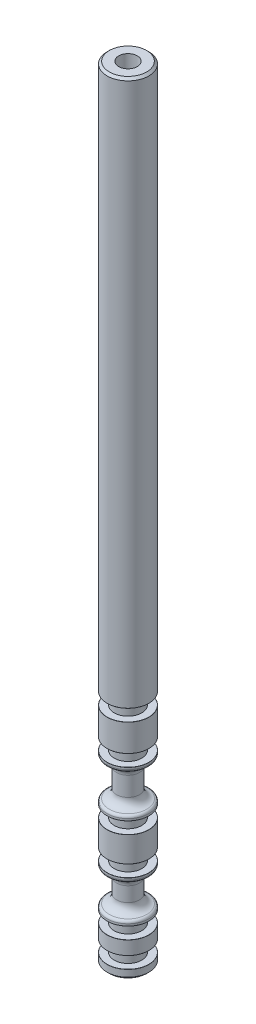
ISO-10303-21;
HEADER;
FILE_DESCRIPTION(('STEP AP214'),'2;1');
FILE_NAME('part.step','',(''),(''),'','','');
FILE_SCHEMA(('AUTOMOTIVE_DESIGN { 1 0 10303 214 1 1 1 1 }'));
ENDSEC;
DATA;
#1=APPLICATION_CONTEXT('core data for automotive mechanical design processes');
#2=APPLICATION_PROTOCOL_DEFINITION('international standard','automotive_design',2000,#1);
#3=PRODUCT_CONTEXT('',#1,'mechanical');
#4=PRODUCT('Part','Part','',(#3));
#5=PRODUCT_RELATED_PRODUCT_CATEGORY('part','',(#4));
#6=PRODUCT_DEFINITION_FORMATION('','',#4);
#7=PRODUCT_DEFINITION_CONTEXT('part definition',#1,'design');
#8=PRODUCT_DEFINITION('design','',#6,#7);
#9=PRODUCT_DEFINITION_SHAPE('','',#8);
#10=(LENGTH_UNIT() NAMED_UNIT(*) SI_UNIT(.MILLI.,.METRE.));
#11=(NAMED_UNIT(*) PLANE_ANGLE_UNIT() SI_UNIT($,.RADIAN.));
#12=(NAMED_UNIT(*) SI_UNIT($,.STERADIAN.) SOLID_ANGLE_UNIT());
#13=UNCERTAINTY_MEASURE_WITH_UNIT(LENGTH_MEASURE(1.E-05),#10,'distance_accuracy_value','');
#14=(GEOMETRIC_REPRESENTATION_CONTEXT(3) GLOBAL_UNCERTAINTY_ASSIGNED_CONTEXT((#13)) GLOBAL_UNIT_ASSIGNED_CONTEXT((#10,
#11,#12)) REPRESENTATION_CONTEXT('',''));
#15=CARTESIAN_POINT('',(0.,0.,0.));
#16=DIRECTION('',(0.,0.,1.));
#17=DIRECTION('',(1.,0.,0.));
#18=AXIS2_PLACEMENT_3D('',#15,#16,#17);
#19=CARTESIAN_POINT('',(0.,-5.94663666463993,0.));
#20=DIRECTION('',(0.,-1.,0.));
#21=DIRECTION('',(0.,0.,-1.));
#22=AXIS2_PLACEMENT_3D('',#19,#20,#21);
#23=CYLINDRICAL_SURFACE('',#22,2.29500000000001);
#24=CARTESIAN_POINT('',(0.,0.250000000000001,0.));
#25=DIRECTION('',(0.,-1.,0.));
#26=DIRECTION('',(0.,0.,-1.));
#27=AXIS2_PLACEMENT_3D('',#24,#25,#26);
#28=CIRCLE('',#27,2.29500000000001);
#29=CARTESIAN_POINT('',(0.,0.250000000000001,-2.29500000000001));
#30=VERTEX_POINT('',#29);
#31=EDGE_CURVE('E209',#30,#30,#28,.F.);
#32=ORIENTED_EDGE('',*,*,#31,.T.);
#33=EDGE_LOOP('',(#32));
#34=FACE_BOUND('',#33,.T.);
#35=CARTESIAN_POINT('',(0.,0.989999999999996,0.));
#36=DIRECTION('',(0.,1.,0.));
#37=DIRECTION('',(0.,0.,1.));
#38=AXIS2_PLACEMENT_3D('',#35,#36,#37);
#39=CIRCLE('',#38,2.29500000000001);
#40=CARTESIAN_POINT('',(0.,0.989999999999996,2.29500000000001));
#41=VERTEX_POINT('',#40);
#42=EDGE_CURVE('E200',#41,#41,#39,.F.);
#43=ORIENTED_EDGE('',*,*,#42,.T.);
#44=EDGE_LOOP('',(#43));
#45=FACE_BOUND('',#44,.T.);
#46=ADVANCED_FACE('F37',(#34,#45),#23,.T.);
#47=CARTESIAN_POINT('',(2.29500000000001,0.,0.));
#48=DIRECTION('',(0.,-1.,0.));
#49=DIRECTION('',(0.,0.,-1.));
#50=AXIS2_PLACEMENT_3D('',#47,#48,#49);
#51=PLANE('',#50);
#52=CARTESIAN_POINT('',(0.,0.,0.));
#53=DIRECTION('',(0.,-1.,0.));
#54=DIRECTION('',(0.,0.,-1.));
#55=AXIS2_PLACEMENT_3D('',#52,#53,#54);
#56=CIRCLE('',#55,2.045);
#57=CARTESIAN_POINT('',(0.,0.,-2.045));
#58=VERTEX_POINT('',#57);
#59=EDGE_CURVE('E206',#58,#58,#56,.T.);
#60=ORIENTED_EDGE('',*,*,#59,.T.);
#61=EDGE_LOOP('',(#60));
#62=FACE_BOUND('',#61,.T.);
#63=ADVANCED_FACE('F227',(#62),#51,.T.);
#64=CARTESIAN_POINT('',(2.5384511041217,2.3,0.));
#65=DIRECTION('',(0.,-1.,0.));
#66=DIRECTION('',(0.,0.,-1.));
#67=AXIS2_PLACEMENT_3D('',#64,#65,#66);
#68=PLANE('',#67);
#69=CARTESIAN_POINT('',(0.,2.3,0.));
#70=DIRECTION('',(0.,-1.,0.));
#71=DIRECTION('',(0.,0.,-1.));
#72=AXIS2_PLACEMENT_3D('',#69,#70,#71);
#73=CIRCLE('',#72,2.285);
#74=CARTESIAN_POINT('',(0.,2.3,2.285));
#75=VERTEX_POINT('',#74);
#76=EDGE_CURVE('E197',#75,#75,#73,.T.);
#77=ORIENTED_EDGE('',*,*,#76,.T.);
#78=EDGE_LOOP('',(#77));
#79=FACE_BOUND('',#78,.T.);
#80=CARTESIAN_POINT('',(0.,2.3,0.));
#81=DIRECTION('',(0.,1.,0.));
#82=DIRECTION('',(0.,0.,1.));
#83=AXIS2_PLACEMENT_3D('',#80,#81,#82);
#84=CIRCLE('',#83,1.51000000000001);
#85=CARTESIAN_POINT('',(0.,2.3,1.51000000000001));
#86=VERTEX_POINT('',#85);
#87=EDGE_CURVE('E77',#86,#86,#84,.T.);
#88=ORIENTED_EDGE('',*,*,#87,.T.);
#89=EDGE_LOOP('',(#88));
#90=FACE_BOUND('',#89,.T.);
#91=ADVANCED_FACE('F234',(#79,#90),#68,.T.);
#92=CARTESIAN_POINT('',(0.,86.3656873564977,0.));
#93=DIRECTION('',(0.,1.,0.));
#94=DIRECTION('',(0.,0.,1.));
#95=AXIS2_PLACEMENT_3D('',#92,#93,#94);
#96=CYLINDRICAL_SURFACE('',#95,1.51000000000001);
#97=CARTESIAN_POINT('',(0.,1.,0.));
#98=DIRECTION('',(0.,1.,0.));
#99=DIRECTION('',(0.,0.,1.));
#100=AXIS2_PLACEMENT_3D('',#97,#98,#99);
#101=CIRCLE('',#100,1.51000000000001);
#102=CARTESIAN_POINT('',(0.,1.,1.51000000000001));
#103=VERTEX_POINT('',#102);
#104=EDGE_CURVE('E74',#103,#103,#101,.T.);
#105=ORIENTED_EDGE('',*,*,#104,.T.);
#106=EDGE_LOOP('',(#105));
#107=FACE_BOUND('',#106,.T.);
#108=ORIENTED_EDGE('',*,*,#87,.F.);
#109=EDGE_LOOP('',(#108));
#110=FACE_BOUND('',#109,.T.);
#111=ADVANCED_FACE('F256',(#107,#110),#96,.T.);
#112=CARTESIAN_POINT('',(1.51000000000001,1.,0.));
#113=DIRECTION('',(0.,1.,0.));
#114=DIRECTION('',(0.,0.,1.));
#115=AXIS2_PLACEMENT_3D('',#112,#113,#114);
#116=PLANE('',#115);
#117=CARTESIAN_POINT('',(0.,1.,0.));
#118=DIRECTION('',(0.,1.,0.));
#119=DIRECTION('',(0.,0.,1.));
#120=AXIS2_PLACEMENT_3D('',#117,#118,#119);
#121=CIRCLE('',#120,2.285);
#122=CARTESIAN_POINT('',(0.,1.,2.285));
#123=VERTEX_POINT('',#122);
#124=EDGE_CURVE('E203',#123,#123,#121,.T.);
#125=ORIENTED_EDGE('',*,*,#124,.T.);
#126=EDGE_LOOP('',(#125));
#127=FACE_BOUND('',#126,.T.);
#128=ORIENTED_EDGE('',*,*,#104,.F.);
#129=EDGE_LOOP('',(#128));
#130=FACE_BOUND('',#129,.T.);
#131=ADVANCED_FACE('F246',(#127,#130),#116,.T.);
#132=CARTESIAN_POINT('',(0.,3.79,0.));
#133=DIRECTION('',(0.,1.,0.));
#134=DIRECTION('',(0.,0.,1.));
#135=AXIS2_PLACEMENT_3D('',#132,#133,#134);
#136=CIRCLE('',#135,2.29500000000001);
#137=CARTESIAN_POINT('',(0.,3.79,2.29500000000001));
#138=VERTEX_POINT('',#137);
#139=EDGE_CURVE('E191',#138,#138,#136,.F.);
#140=ORIENTED_EDGE('',*,*,#139,.T.);
#141=EDGE_LOOP('',(#140));
#142=FACE_BOUND('',#141,.T.);
#143=CARTESIAN_POINT('',(0.,2.31000000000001,0.));
#144=DIRECTION('',(0.,-1.,0.));
#145=DIRECTION('',(0.,0.,-1.));
#146=AXIS2_PLACEMENT_3D('',#143,#144,#145);
#147=CIRCLE('',#146,2.29500000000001);
#148=CARTESIAN_POINT('',(0.,2.31000000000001,2.29500000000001));
#149=VERTEX_POINT('',#148);
#150=EDGE_CURVE('E188',#149,#149,#147,.F.);
#151=ORIENTED_EDGE('',*,*,#150,.T.);
#152=EDGE_LOOP('',(#151));
#153=FACE_BOUND('',#152,.T.);
#154=ADVANCED_FACE('F230',(#142,#153),#23,.T.);
#155=CARTESIAN_POINT('',(2.53845110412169,5.1,0.));
#156=DIRECTION('',(0.,-1.,0.));
#157=DIRECTION('',(0.,0.,-1.));
#158=AXIS2_PLACEMENT_3D('',#155,#156,#157);
#159=PLANE('',#158);
#160=CARTESIAN_POINT('',(0.,5.1,0.));
#161=DIRECTION('',(0.,-1.,0.));
#162=DIRECTION('',(0.,0.,-1.));
#163=AXIS2_PLACEMENT_3D('',#160,#161,#162);
#164=CIRCLE('',#163,2.285);
#165=CARTESIAN_POINT('',(0.,5.1,2.285));
#166=VERTEX_POINT('',#165);
#167=EDGE_CURVE('E185',#166,#166,#164,.T.);
#168=ORIENTED_EDGE('',*,*,#167,.T.);
#169=EDGE_LOOP('',(#168));
#170=FACE_BOUND('',#169,.T.);
#171=CARTESIAN_POINT('',(0.,5.09999999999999,0.));
#172=DIRECTION('',(0.,1.,0.));
#173=DIRECTION('',(0.,0.,1.));
#174=AXIS2_PLACEMENT_3D('',#171,#172,#173);
#175=CIRCLE('',#174,1.51000000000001);
#176=CARTESIAN_POINT('',(0.,5.09999999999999,1.51000000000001));
#177=VERTEX_POINT('',#176);
#178=EDGE_CURVE('E83',#177,#177,#175,.T.);
#179=ORIENTED_EDGE('',*,*,#178,.T.);
#180=EDGE_LOOP('',(#179));
#181=FACE_BOUND('',#180,.T.);
#182=ADVANCED_FACE('F245',(#170,#181),#159,.T.);
#183=CARTESIAN_POINT('',(0.,86.3656873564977,0.));
#184=DIRECTION('',(0.,1.,0.));
#185=DIRECTION('',(0.,0.,1.));
#186=AXIS2_PLACEMENT_3D('',#183,#184,#185);
#187=CYLINDRICAL_SURFACE('',#186,1.51000000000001);
#188=CARTESIAN_POINT('',(0.,3.8,0.));
#189=DIRECTION('',(0.,1.,0.));
#190=DIRECTION('',(0.,0.,1.));
#191=AXIS2_PLACEMENT_3D('',#188,#189,#190);
#192=CIRCLE('',#191,1.51000000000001);
#193=CARTESIAN_POINT('',(0.,3.8,1.51000000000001));
#194=VERTEX_POINT('',#193);
#195=EDGE_CURVE('E80',#194,#194,#192,.T.);
#196=ORIENTED_EDGE('',*,*,#195,.T.);
#197=EDGE_LOOP('',(#196));
#198=FACE_BOUND('',#197,.T.);
#199=ORIENTED_EDGE('',*,*,#178,.F.);
#200=EDGE_LOOP('',(#199));
#201=FACE_BOUND('',#200,.T.);
#202=ADVANCED_FACE('F253',(#198,#201),#187,.T.);
#203=CARTESIAN_POINT('',(1.51000000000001,3.8,0.));
#204=DIRECTION('',(0.,1.,0.));
#205=DIRECTION('',(0.,0.,1.));
#206=AXIS2_PLACEMENT_3D('',#203,#204,#205);
#207=PLANE('',#206);
#208=CARTESIAN_POINT('',(0.,3.8,0.));
#209=DIRECTION('',(0.,1.,0.));
#210=DIRECTION('',(0.,0.,1.));
#211=AXIS2_PLACEMENT_3D('',#208,#209,#210);
#212=CIRCLE('',#211,2.285);
#213=CARTESIAN_POINT('',(0.,3.8,2.285));
#214=VERTEX_POINT('',#213);
#215=EDGE_CURVE('E194',#214,#214,#212,.T.);
#216=ORIENTED_EDGE('',*,*,#215,.T.);
#217=EDGE_LOOP('',(#216));
#218=FACE_BOUND('',#217,.T.);
#219=ORIENTED_EDGE('',*,*,#195,.F.);
#220=EDGE_LOOP('',(#219));
#221=FACE_BOUND('',#220,.T.);
#222=ADVANCED_FACE('F262',(#218,#221),#207,.T.);
#223=CARTESIAN_POINT('',(0.,5.11000000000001,0.));
#224=DIRECTION('',(0.,-1.,0.));
#225=DIRECTION('',(0.,0.,-1.));
#226=AXIS2_PLACEMENT_3D('',#223,#224,#225);
#227=CIRCLE('',#226,2.29500000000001);
#228=CARTESIAN_POINT('',(0.,5.11000000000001,2.29500000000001));
#229=VERTEX_POINT('',#228);
#230=EDGE_CURVE('E182',#229,#229,#227,.F.);
#231=ORIENTED_EDGE('',*,*,#230,.T.);
#232=EDGE_LOOP('',(#231));
#233=FACE_BOUND('',#232,.T.);
#234=CARTESIAN_POINT('',(0.,5.32525492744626,0.));
#235=DIRECTION('',(0.,1.,0.));
#236=DIRECTION('',(0.,0.,1.));
#237=AXIS2_PLACEMENT_3D('',#234,#235,#236);
#238=CIRCLE('',#237,2.29500000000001);
#239=CARTESIAN_POINT('',(0.,5.32525492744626,2.29500000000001));
#240=VERTEX_POINT('',#239);
#241=EDGE_CURVE('E128',#240,#240,#238,.F.);
#242=ORIENTED_EDGE('',*,*,#241,.T.);
#243=EDGE_LOOP('',(#242));
#244=FACE_BOUND('',#243,.T.);
#245=ADVANCED_FACE('F248',(#233,#244),#23,.T.);
#246=CARTESIAN_POINT('',(0.,86.3656873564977,0.));
#247=DIRECTION('',(0.,1.,0.));
#248=DIRECTION('',(0.,0.,1.));
#249=AXIS2_PLACEMENT_3D('',#246,#247,#248);
#250=CYLINDRICAL_SURFACE('',#249,1.25000000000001);
#251=CARTESIAN_POINT('',(0.,6.59999999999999,0.));
#252=DIRECTION('',(0.,1.,0.));
#253=DIRECTION('',(0.,0.,1.));
#254=AXIS2_PLACEMENT_3D('',#251,#252,#253);
#255=CIRCLE('',#254,1.25000000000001);
#256=CARTESIAN_POINT('',(0.,6.59999999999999,1.25000000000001));
#257=VERTEX_POINT('',#256);
#258=EDGE_CURVE('E101',#257,#257,#255,.T.);
#259=ORIENTED_EDGE('',*,*,#258,.T.);
#260=EDGE_LOOP('',(#259));
#261=FACE_BOUND('',#260,.T.);
#262=CARTESIAN_POINT('',(0.,8.2,0.));
#263=DIRECTION('',(0.,-1.,0.));
#264=DIRECTION('',(0.,0.,-1.));
#265=AXIS2_PLACEMENT_3D('',#262,#263,#264);
#266=CIRCLE('',#265,1.25000000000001);
#267=CARTESIAN_POINT('',(0.,8.2,-1.25000000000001));
#268=VERTEX_POINT('',#267);
#269=EDGE_CURVE('E98',#268,#268,#266,.T.);
#270=ORIENTED_EDGE('',*,*,#269,.T.);
#271=EDGE_LOOP('',(#270));
#272=FACE_BOUND('',#271,.T.);
#273=ADVANCED_FACE('F261',(#261,#272),#250,.T.);
#274=CARTESIAN_POINT('',(0.,9.68999999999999,0.));
#275=DIRECTION('',(0.,1.,0.));
#276=DIRECTION('',(0.,0.,1.));
#277=AXIS2_PLACEMENT_3D('',#274,#275,#276);
#278=CIRCLE('',#277,2.29500000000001);
#279=CARTESIAN_POINT('',(0.,9.68999999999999,-2.29500000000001));
#280=VERTEX_POINT('',#279);
#281=EDGE_CURVE('E176',#280,#280,#278,.F.);
#282=ORIENTED_EDGE('',*,*,#281,.T.);
#283=EDGE_LOOP('',(#282));
#284=FACE_BOUND('',#283,.T.);
#285=CARTESIAN_POINT('',(0.,9.47474507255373,0.));
#286=DIRECTION('',(0.,-1.,0.));
#287=DIRECTION('',(0.,0.,-1.));
#288=AXIS2_PLACEMENT_3D('',#285,#286,#287);
#289=CIRCLE('',#288,2.29500000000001);
#290=CARTESIAN_POINT('',(0.,9.47474507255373,-2.29500000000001));
#291=VERTEX_POINT('',#290);
#292=EDGE_CURVE('E122',#291,#291,#289,.F.);
#293=ORIENTED_EDGE('',*,*,#292,.T.);
#294=EDGE_LOOP('',(#293));
#295=FACE_BOUND('',#294,.T.);
#296=ADVANCED_FACE('F264',(#284,#295),#23,.T.);
#297=CARTESIAN_POINT('',(1.51000000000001,11.,0.));
#298=DIRECTION('',(0.,-1.,0.));
#299=DIRECTION('',(0.,0.,-1.));
#300=AXIS2_PLACEMENT_3D('',#297,#298,#299);
#301=PLANE('',#300);
#302=CARTESIAN_POINT('',(0.,11.,0.));
#303=DIRECTION('',(0.,-1.,0.));
#304=DIRECTION('',(0.,0.,-1.));
#305=AXIS2_PLACEMENT_3D('',#302,#303,#304);
#306=CIRCLE('',#305,2.28500000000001);
#307=CARTESIAN_POINT('',(0.,11.,-2.28500000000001));
#308=VERTEX_POINT('',#307);
#309=EDGE_CURVE('E173',#308,#308,#306,.T.);
#310=ORIENTED_EDGE('',*,*,#309,.T.);
#311=EDGE_LOOP('',(#310));
#312=FACE_BOUND('',#311,.T.);
#313=CARTESIAN_POINT('',(0.,11.,0.));
#314=DIRECTION('',(0.,1.,0.));
#315=DIRECTION('',(0.,0.,1.));
#316=AXIS2_PLACEMENT_3D('',#313,#314,#315);
#317=CIRCLE('',#316,1.51000000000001);
#318=CARTESIAN_POINT('',(0.,11.,1.51000000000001));
#319=VERTEX_POINT('',#318);
#320=EDGE_CURVE('E89',#319,#319,#317,.T.);
#321=ORIENTED_EDGE('',*,*,#320,.T.);
#322=EDGE_LOOP('',(#321));
#323=FACE_BOUND('',#322,.T.);
#324=ADVANCED_FACE('F275',(#312,#323),#301,.T.);
#325=CARTESIAN_POINT('',(0.,86.3656873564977,0.));
#326=DIRECTION('',(0.,1.,0.));
#327=DIRECTION('',(0.,0.,1.));
#328=AXIS2_PLACEMENT_3D('',#325,#326,#327);
#329=CYLINDRICAL_SURFACE('',#328,1.51000000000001);
#330=CARTESIAN_POINT('',(0.,9.7,0.));
#331=DIRECTION('',(0.,1.,0.));
#332=DIRECTION('',(0.,0.,1.));
#333=AXIS2_PLACEMENT_3D('',#330,#331,#332);
#334=CIRCLE('',#333,1.51000000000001);
#335=CARTESIAN_POINT('',(0.,9.7,1.51000000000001));
#336=VERTEX_POINT('',#335);
#337=EDGE_CURVE('E86',#336,#336,#334,.T.);
#338=ORIENTED_EDGE('',*,*,#337,.T.);
#339=EDGE_LOOP('',(#338));
#340=FACE_BOUND('',#339,.T.);
#341=ORIENTED_EDGE('',*,*,#320,.F.);
#342=EDGE_LOOP('',(#341));
#343=FACE_BOUND('',#342,.T.);
#344=ADVANCED_FACE('F281',(#340,#343),#329,.T.);
#345=CARTESIAN_POINT('',(1.51000000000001,9.7,0.));
#346=DIRECTION('',(0.,1.,0.));
#347=DIRECTION('',(0.,0.,1.));
#348=AXIS2_PLACEMENT_3D('',#345,#346,#347);
#349=PLANE('',#348);
#350=CARTESIAN_POINT('',(0.,9.7,0.));
#351=DIRECTION('',(0.,1.,0.));
#352=DIRECTION('',(0.,0.,1.));
#353=AXIS2_PLACEMENT_3D('',#350,#351,#352);
#354=CIRCLE('',#353,2.285);
#355=CARTESIAN_POINT('',(0.,9.7,-2.285));
#356=VERTEX_POINT('',#355);
#357=EDGE_CURVE('E179',#356,#356,#354,.T.);
#358=ORIENTED_EDGE('',*,*,#357,.T.);
#359=EDGE_LOOP('',(#358));
#360=FACE_BOUND('',#359,.T.);
#361=ORIENTED_EDGE('',*,*,#337,.F.);
#362=EDGE_LOOP('',(#361));
#363=FACE_BOUND('',#362,.T.);
#364=ADVANCED_FACE('F287',(#360,#363),#349,.T.);
#365=CARTESIAN_POINT('',(0.,13.79,0.));
#366=DIRECTION('',(0.,1.,0.));
#367=DIRECTION('',(0.,0.,1.));
#368=AXIS2_PLACEMENT_3D('',#365,#366,#367);
#369=CIRCLE('',#368,2.29500000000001);
#370=CARTESIAN_POINT('',(0.,13.79,2.29500000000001));
#371=VERTEX_POINT('',#370);
#372=EDGE_CURVE('E167',#371,#371,#369,.F.);
#373=ORIENTED_EDGE('',*,*,#372,.T.);
#374=EDGE_LOOP('',(#373));
#375=FACE_BOUND('',#374,.T.);
#376=CARTESIAN_POINT('',(0.,11.01,0.));
#377=DIRECTION('',(0.,-1.,0.));
#378=DIRECTION('',(0.,0.,-1.));
#379=AXIS2_PLACEMENT_3D('',#376,#377,#378);
#380=CIRCLE('',#379,2.29500000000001);
#381=CARTESIAN_POINT('',(0.,11.01,-2.29500000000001));
#382=VERTEX_POINT('',#381);
#383=EDGE_CURVE('E164',#382,#382,#380,.F.);
#384=ORIENTED_EDGE('',*,*,#383,.T.);
#385=EDGE_LOOP('',(#384));
#386=FACE_BOUND('',#385,.T.);
#387=ADVANCED_FACE('F277',(#375,#386),#23,.T.);
#388=CARTESIAN_POINT('',(2.5384511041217,15.1,0.));
#389=DIRECTION('',(0.,-1.,0.));
#390=DIRECTION('',(0.,0.,-1.));
#391=AXIS2_PLACEMENT_3D('',#388,#389,#390);
#392=PLANE('',#391);
#393=CARTESIAN_POINT('',(0.,15.1,0.));
#394=DIRECTION('',(0.,-1.,0.));
#395=DIRECTION('',(0.,0.,-1.));
#396=AXIS2_PLACEMENT_3D('',#393,#394,#395);
#397=CIRCLE('',#396,2.28500000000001);
#398=CARTESIAN_POINT('',(0.,15.1,-2.28500000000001));
#399=VERTEX_POINT('',#398);
#400=EDGE_CURVE('E161',#399,#399,#397,.T.);
#401=ORIENTED_EDGE('',*,*,#400,.T.);
#402=EDGE_LOOP('',(#401));
#403=FACE_BOUND('',#402,.T.);
#404=CARTESIAN_POINT('',(0.,15.1,0.));
#405=DIRECTION('',(0.,1.,0.));
#406=DIRECTION('',(0.,0.,1.));
#407=AXIS2_PLACEMENT_3D('',#404,#405,#406);
#408=CIRCLE('',#407,1.51000000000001);
#409=CARTESIAN_POINT('',(0.,15.1,1.51000000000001));
#410=VERTEX_POINT('',#409);
#411=EDGE_CURVE('E95',#410,#410,#408,.T.);
#412=ORIENTED_EDGE('',*,*,#411,.T.);
#413=EDGE_LOOP('',(#412));
#414=FACE_BOUND('',#413,.T.);
#415=ADVANCED_FACE('F286',(#403,#414),#392,.T.);
#416=CARTESIAN_POINT('',(0.,86.3656873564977,0.));
#417=DIRECTION('',(0.,1.,0.));
#418=DIRECTION('',(0.,0.,1.));
#419=AXIS2_PLACEMENT_3D('',#416,#417,#418);
#420=CYLINDRICAL_SURFACE('',#419,1.51000000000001);
#421=CARTESIAN_POINT('',(0.,13.8,0.));
#422=DIRECTION('',(0.,1.,0.));
#423=DIRECTION('',(0.,0.,1.));
#424=AXIS2_PLACEMENT_3D('',#421,#422,#423);
#425=CIRCLE('',#424,1.51000000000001);
#426=CARTESIAN_POINT('',(0.,13.8,1.51000000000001));
#427=VERTEX_POINT('',#426);
#428=EDGE_CURVE('E92',#427,#427,#425,.T.);
#429=ORIENTED_EDGE('',*,*,#428,.T.);
#430=EDGE_LOOP('',(#429));
#431=FACE_BOUND('',#430,.T.);
#432=ORIENTED_EDGE('',*,*,#411,.F.);
#433=EDGE_LOOP('',(#432));
#434=FACE_BOUND('',#433,.T.);
#435=ADVANCED_FACE('F293',(#431,#434),#420,.T.);
#436=CARTESIAN_POINT('',(1.51000000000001,13.8,0.));
#437=DIRECTION('',(0.,1.,0.));
#438=DIRECTION('',(0.,0.,1.));
#439=AXIS2_PLACEMENT_3D('',#436,#437,#438);
#440=PLANE('',#439);
#441=CARTESIAN_POINT('',(0.,13.8,0.));
#442=DIRECTION('',(0.,1.,0.));
#443=DIRECTION('',(0.,0.,1.));
#444=AXIS2_PLACEMENT_3D('',#441,#442,#443);
#445=CIRCLE('',#444,2.285);
#446=CARTESIAN_POINT('',(0.,13.8,2.285));
#447=VERTEX_POINT('',#446);
#448=EDGE_CURVE('E170',#447,#447,#445,.T.);
#449=ORIENTED_EDGE('',*,*,#448,.T.);
#450=EDGE_LOOP('',(#449));
#451=FACE_BOUND('',#450,.T.);
#452=ORIENTED_EDGE('',*,*,#428,.F.);
#453=EDGE_LOOP('',(#452));
#454=FACE_BOUND('',#453,.T.);
#455=ADVANCED_FACE('F301',(#451,#454),#440,.T.);
#456=CARTESIAN_POINT('',(0.,15.11,0.));
#457=DIRECTION('',(0.,-1.,0.));
#458=DIRECTION('',(0.,0.,-1.));
#459=AXIS2_PLACEMENT_3D('',#456,#457,#458);
#460=CIRCLE('',#459,2.29500000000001);
#461=CARTESIAN_POINT('',(0.,15.11,-2.29500000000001));
#462=VERTEX_POINT('',#461);
#463=EDGE_CURVE('E158',#462,#462,#460,.F.);
#464=ORIENTED_EDGE('',*,*,#463,.T.);
#465=EDGE_LOOP('',(#464));
#466=FACE_BOUND('',#465,.T.);
#467=CARTESIAN_POINT('',(0.,15.3252549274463,0.));
#468=DIRECTION('',(0.,1.,0.));
#469=DIRECTION('',(0.,0.,1.));
#470=AXIS2_PLACEMENT_3D('',#467,#468,#469);
#471=CIRCLE('',#470,2.29500000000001);
#472=CARTESIAN_POINT('',(0.,15.3252549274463,2.29500000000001));
#473=VERTEX_POINT('',#472);
#474=EDGE_CURVE('E116',#473,#473,#471,.F.);
#475=ORIENTED_EDGE('',*,*,#474,.T.);
#476=EDGE_LOOP('',(#475));
#477=FACE_BOUND('',#476,.T.);
#478=ADVANCED_FACE('F238',(#466,#477),#23,.T.);
#479=CARTESIAN_POINT('',(0.,86.3656873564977,0.));
#480=DIRECTION('',(0.,1.,0.));
#481=DIRECTION('',(0.,0.,1.));
#482=AXIS2_PLACEMENT_3D('',#479,#480,#481);
#483=CYLINDRICAL_SURFACE('',#482,1.25000000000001);
#484=CARTESIAN_POINT('',(0.,16.6,0.));
#485=DIRECTION('',(0.,1.,0.));
#486=DIRECTION('',(0.,0.,1.));
#487=AXIS2_PLACEMENT_3D('',#484,#485,#486);
#488=CIRCLE('',#487,1.25000000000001);
#489=CARTESIAN_POINT('',(0.,16.6,1.25000000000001));
#490=VERTEX_POINT('',#489);
#491=EDGE_CURVE('E107',#490,#490,#488,.T.);
#492=ORIENTED_EDGE('',*,*,#491,.T.);
#493=EDGE_LOOP('',(#492));
#494=FACE_BOUND('',#493,.T.);
#495=CARTESIAN_POINT('',(0.,18.7,0.));
#496=DIRECTION('',(0.,-1.,0.));
#497=DIRECTION('',(0.,0.,-1.));
#498=AXIS2_PLACEMENT_3D('',#495,#496,#497);
#499=CIRCLE('',#498,1.25000000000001);
#500=CARTESIAN_POINT('',(0.,18.7,-1.25000000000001));
#501=VERTEX_POINT('',#500);
#502=EDGE_CURVE('E104',#501,#501,#499,.T.);
#503=ORIENTED_EDGE('',*,*,#502,.T.);
#504=EDGE_LOOP('',(#503));
#505=FACE_BOUND('',#504,.T.);
#506=ADVANCED_FACE('F300',(#494,#505),#483,.T.);
#507=CARTESIAN_POINT('',(0.,20.19,0.));
#508=DIRECTION('',(0.,1.,0.));
#509=DIRECTION('',(0.,0.,1.));
#510=AXIS2_PLACEMENT_3D('',#507,#508,#509);
#511=CIRCLE('',#510,2.29500000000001);
#512=CARTESIAN_POINT('',(0.,20.19,2.29500000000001));
#513=VERTEX_POINT('',#512);
#514=EDGE_CURVE('E152',#513,#513,#511,.F.);
#515=ORIENTED_EDGE('',*,*,#514,.T.);
#516=EDGE_LOOP('',(#515));
#517=FACE_BOUND('',#516,.T.);
#518=CARTESIAN_POINT('',(0.,19.9747450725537,0.));
#519=DIRECTION('',(0.,-1.,0.));
#520=DIRECTION('',(0.,0.,-1.));
#521=AXIS2_PLACEMENT_3D('',#518,#519,#520);
#522=CIRCLE('',#521,2.29500000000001);
#523=CARTESIAN_POINT('',(0.,19.9747450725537,-2.29500000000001));
#524=VERTEX_POINT('',#523);
#525=EDGE_CURVE('E110',#524,#524,#522,.F.);
#526=ORIENTED_EDGE('',*,*,#525,.T.);
#527=EDGE_LOOP('',(#526));
#528=FACE_BOUND('',#527,.T.);
#529=ADVANCED_FACE('F303',(#517,#528),#23,.T.);
#530=CARTESIAN_POINT('',(1.51000000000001,21.5,0.));
#531=DIRECTION('',(0.,-1.,0.));
#532=DIRECTION('',(0.,0.,-1.));
#533=AXIS2_PLACEMENT_3D('',#530,#531,#532);
#534=PLANE('',#533);
#535=CARTESIAN_POINT('',(0.,21.5,0.));
#536=DIRECTION('',(0.,-1.,0.));
#537=DIRECTION('',(0.,0.,-1.));
#538=AXIS2_PLACEMENT_3D('',#535,#536,#537);
#539=CIRCLE('',#538,2.285);
#540=CARTESIAN_POINT('',(0.,21.5,-2.285));
#541=VERTEX_POINT('',#540);
#542=EDGE_CURVE('E149',#541,#541,#539,.T.);
#543=ORIENTED_EDGE('',*,*,#542,.T.);
#544=EDGE_LOOP('',(#543));
#545=FACE_BOUND('',#544,.T.);
#546=CARTESIAN_POINT('',(0.,21.5,0.));
#547=DIRECTION('',(0.,1.,0.));
#548=DIRECTION('',(0.,0.,1.));
#549=AXIS2_PLACEMENT_3D('',#546,#547,#548);
#550=CIRCLE('',#549,1.51000000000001);
#551=CARTESIAN_POINT('',(0.,21.5,1.51000000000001));
#552=VERTEX_POINT('',#551);
#553=EDGE_CURVE('E61',#552,#552,#550,.T.);
#554=ORIENTED_EDGE('',*,*,#553,.T.);
#555=EDGE_LOOP('',(#554));
#556=FACE_BOUND('',#555,.T.);
#557=ADVANCED_FACE('F314',(#545,#556),#534,.T.);
#558=CARTESIAN_POINT('',(0.,86.3656873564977,0.));
#559=DIRECTION('',(0.,1.,0.));
#560=DIRECTION('',(0.,0.,1.));
#561=AXIS2_PLACEMENT_3D('',#558,#559,#560);
#562=CYLINDRICAL_SURFACE('',#561,1.51000000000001);
#563=CARTESIAN_POINT('',(0.,20.2,0.));
#564=DIRECTION('',(0.,1.,0.));
#565=DIRECTION('',(0.,0.,1.));
#566=AXIS2_PLACEMENT_3D('',#563,#564,#565);
#567=CIRCLE('',#566,1.51000000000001);
#568=CARTESIAN_POINT('',(0.,20.2,1.51000000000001));
#569=VERTEX_POINT('',#568);
#570=EDGE_CURVE('E57',#569,#569,#567,.T.);
#571=ORIENTED_EDGE('',*,*,#570,.T.);
#572=EDGE_LOOP('',(#571));
#573=FACE_BOUND('',#572,.T.);
#574=ORIENTED_EDGE('',*,*,#553,.F.);
#575=EDGE_LOOP('',(#574));
#576=FACE_BOUND('',#575,.T.);
#577=ADVANCED_FACE('F319',(#573,#576),#562,.T.);
#578=CARTESIAN_POINT('',(1.51000000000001,20.2,0.));
#579=DIRECTION('',(0.,1.,0.));
#580=DIRECTION('',(0.,0.,1.));
#581=AXIS2_PLACEMENT_3D('',#578,#579,#580);
#582=PLANE('',#581);
#583=CARTESIAN_POINT('',(0.,20.2,0.));
#584=DIRECTION('',(0.,1.,0.));
#585=DIRECTION('',(0.,0.,1.));
#586=AXIS2_PLACEMENT_3D('',#583,#584,#585);
#587=CIRCLE('',#586,2.28500000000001);
#588=CARTESIAN_POINT('',(0.,20.2,2.28500000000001));
#589=VERTEX_POINT('',#588);
#590=EDGE_CURVE('E155',#589,#589,#587,.T.);
#591=ORIENTED_EDGE('',*,*,#590,.T.);
#592=EDGE_LOOP('',(#591));
#593=FACE_BOUND('',#592,.T.);
#594=ORIENTED_EDGE('',*,*,#570,.F.);
#595=EDGE_LOOP('',(#594));
#596=FACE_BOUND('',#595,.T.);
#597=ADVANCED_FACE('F325',(#593,#596),#582,.T.);
#598=CARTESIAN_POINT('',(0.,24.49,0.));
#599=DIRECTION('',(0.,1.,0.));
#600=DIRECTION('',(0.,0.,1.));
#601=AXIS2_PLACEMENT_3D('',#598,#599,#600);
#602=CIRCLE('',#601,2.29500000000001);
#603=CARTESIAN_POINT('',(0.,24.49,2.29500000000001));
#604=VERTEX_POINT('',#603);
#605=EDGE_CURVE('E143',#604,#604,#602,.F.);
#606=ORIENTED_EDGE('',*,*,#605,.T.);
#607=EDGE_LOOP('',(#606));
#608=FACE_BOUND('',#607,.T.);
#609=CARTESIAN_POINT('',(0.,21.51,0.));
#610=DIRECTION('',(0.,-1.,0.));
#611=DIRECTION('',(0.,0.,-1.));
#612=AXIS2_PLACEMENT_3D('',#609,#610,#611);
#613=CIRCLE('',#612,2.29500000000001);
#614=CARTESIAN_POINT('',(0.,21.51,-2.29500000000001));
#615=VERTEX_POINT('',#614);
#616=EDGE_CURVE('E140',#615,#615,#613,.F.);
#617=ORIENTED_EDGE('',*,*,#616,.T.);
#618=EDGE_LOOP('',(#617));
#619=FACE_BOUND('',#618,.T.);
#620=ADVANCED_FACE('F243',(#608,#619),#23,.T.);
#621=CARTESIAN_POINT('',(1.51000000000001,25.8,0.));
#622=DIRECTION('',(0.,-1.,0.));
#623=DIRECTION('',(0.,0.,-1.));
#624=AXIS2_PLACEMENT_3D('',#621,#622,#623);
#625=PLANE('',#624);
#626=CARTESIAN_POINT('',(0.,25.8,0.));
#627=DIRECTION('',(0.,-1.,0.));
#628=DIRECTION('',(0.,0.,-1.));
#629=AXIS2_PLACEMENT_3D('',#626,#627,#628);
#630=CIRCLE('',#629,2.285);
#631=CARTESIAN_POINT('',(0.,25.8,-2.285));
#632=VERTEX_POINT('',#631);
#633=EDGE_CURVE('E137',#632,#632,#630,.T.);
#634=ORIENTED_EDGE('',*,*,#633,.T.);
#635=EDGE_LOOP('',(#634));
#636=FACE_BOUND('',#635,.T.);
#637=CARTESIAN_POINT('',(0.,25.8,0.));
#638=DIRECTION('',(0.,1.,0.));
#639=DIRECTION('',(0.,0.,1.));
#640=AXIS2_PLACEMENT_3D('',#637,#638,#639);
#641=CIRCLE('',#640,1.51000000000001);
#642=CARTESIAN_POINT('',(0.,25.8,1.51000000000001));
#643=VERTEX_POINT('',#642);
#644=EDGE_CURVE('E71',#643,#643,#641,.T.);
#645=ORIENTED_EDGE('',*,*,#644,.T.);
#646=EDGE_LOOP('',(#645));
#647=FACE_BOUND('',#646,.T.);
#648=ADVANCED_FACE('F324',(#636,#647),#625,.T.);
#649=CARTESIAN_POINT('',(0.,86.3656873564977,0.));
#650=DIRECTION('',(0.,1.,0.));
#651=DIRECTION('',(0.,0.,1.));
#652=AXIS2_PLACEMENT_3D('',#649,#650,#651);
#653=CYLINDRICAL_SURFACE('',#652,1.51000000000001);
#654=CARTESIAN_POINT('',(0.,24.5,0.));
#655=DIRECTION('',(0.,1.,0.));
#656=DIRECTION('',(0.,0.,1.));
#657=AXIS2_PLACEMENT_3D('',#654,#655,#656);
#658=CIRCLE('',#657,1.51000000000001);
#659=CARTESIAN_POINT('',(0.,24.5,1.51000000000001));
#660=VERTEX_POINT('',#659);
#661=EDGE_CURVE('E68',#660,#660,#658,.T.);
#662=ORIENTED_EDGE('',*,*,#661,.T.);
#663=EDGE_LOOP('',(#662));
#664=FACE_BOUND('',#663,.T.);
#665=ORIENTED_EDGE('',*,*,#644,.F.);
#666=EDGE_LOOP('',(#665));
#667=FACE_BOUND('',#666,.T.);
#668=ADVANCED_FACE('F331',(#664,#667),#653,.T.);
#669=CARTESIAN_POINT('',(2.5384511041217,24.5,0.));
#670=DIRECTION('',(0.,1.,0.));
#671=DIRECTION('',(0.,0.,1.));
#672=AXIS2_PLACEMENT_3D('',#669,#670,#671);
#673=PLANE('',#672);
#674=CARTESIAN_POINT('',(0.,24.5,0.));
#675=DIRECTION('',(0.,1.,0.));
#676=DIRECTION('',(0.,0.,1.));
#677=AXIS2_PLACEMENT_3D('',#674,#675,#676);
#678=CIRCLE('',#677,2.28500000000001);
#679=CARTESIAN_POINT('',(0.,24.5,2.28500000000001));
#680=VERTEX_POINT('',#679);
#681=EDGE_CURVE('E146',#680,#680,#678,.T.);
#682=ORIENTED_EDGE('',*,*,#681,.T.);
#683=EDGE_LOOP('',(#682));
#684=FACE_BOUND('',#683,.T.);
#685=ORIENTED_EDGE('',*,*,#661,.F.);
#686=EDGE_LOOP('',(#685));
#687=FACE_BOUND('',#686,.T.);
#688=ADVANCED_FACE('F476',(#684,#687),#673,.T.);
#689=CARTESIAN_POINT('',(0.,85.69,0.));
#690=DIRECTION('',(0.,1.,0.));
#691=DIRECTION('',(0.,0.,1.));
#692=AXIS2_PLACEMENT_3D('',#689,#690,#691);
#693=PLANE('',#692);
#694=CARTESIAN_POINT('',(0.,85.69,0.));
#695=DIRECTION('',(0.,1.,0.));
#696=DIRECTION('',(0.,0.,1.));
#697=AXIS2_PLACEMENT_3D('',#694,#695,#696);
#698=CIRCLE('',#697,2.04499999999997);
#699=CARTESIAN_POINT('',(0.,85.69,2.04499999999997));
#700=VERTEX_POINT('',#699);
#701=EDGE_CURVE('E11',#700,#700,#698,.T.);
#702=ORIENTED_EDGE('',*,*,#701,.T.);
#703=EDGE_LOOP('',(#702));
#704=FACE_BOUND('',#703,.T.);
#705=CARTESIAN_POINT('',(0.,85.69,0.));
#706=DIRECTION('',(0.,1.,0.));
#707=DIRECTION('',(0.,0.,1.));
#708=AXIS2_PLACEMENT_3D('',#705,#706,#707);
#709=CIRCLE('',#708,1.025);
#710=CARTESIAN_POINT('',(0.,85.69,1.025));
#711=VERTEX_POINT('',#710);
#712=EDGE_CURVE('E58',#711,#711,#709,.T.);
#713=ORIENTED_EDGE('',*,*,#712,.F.);
#714=EDGE_LOOP('',(#713));
#715=FACE_BOUND('',#714,.T.);
#716=ADVANCED_FACE('F242',(#704,#715),#693,.T.);
#717=CARTESIAN_POINT('',(0.,85.44,0.));
#718=DIRECTION('',(0.,1.,0.));
#719=DIRECTION('',(0.,0.,1.));
#720=AXIS2_PLACEMENT_3D('',#717,#718,#719);
#721=CIRCLE('',#720,2.29500000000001);
#722=CARTESIAN_POINT('',(0.,85.44,2.29500000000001));
#723=VERTEX_POINT('',#722);
#724=EDGE_CURVE('E44',#723,#723,#721,.F.);
#725=ORIENTED_EDGE('',*,*,#724,.T.);
#726=EDGE_LOOP('',(#725));
#727=FACE_BOUND('',#726,.T.);
#728=CARTESIAN_POINT('',(0.,25.81,0.));
#729=DIRECTION('',(0.,-1.,0.));
#730=DIRECTION('',(0.,0.,-1.));
#731=AXIS2_PLACEMENT_3D('',#728,#729,#730);
#732=CIRCLE('',#731,2.29500000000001);
#733=CARTESIAN_POINT('',(0.,25.81,-2.29500000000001));
#734=VERTEX_POINT('',#733);
#735=EDGE_CURVE('E134',#734,#734,#732,.F.);
#736=ORIENTED_EDGE('',*,*,#735,.T.);
#737=EDGE_LOOP('',(#736));
#738=FACE_BOUND('',#737,.T.);
#739=ADVANCED_FACE('F214',(#727,#738),#23,.T.);
#740=CARTESIAN_POINT('',(0.,6.59999999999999,0.));
#741=DIRECTION('',(0.,1.,0.));
#742=DIRECTION('',(0.,0.,1.));
#743=AXIS2_PLACEMENT_3D('',#740,#741,#742);
#744=TOROIDAL_SURFACE('',#743,2.25000000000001,1.);
#745=CARTESIAN_POINT('',(0.,5.61942686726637,0.));
#746=DIRECTION('',(0.,1.,0.));
#747=DIRECTION('',(0.,0.,1.));
#748=AXIS2_PLACEMENT_3D('',#745,#746,#747);
#749=CIRCLE('',#748,2.05384615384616);
#750=CARTESIAN_POINT('',(0.,5.61942686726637,2.05384615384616));
#751=VERTEX_POINT('',#750);
#752=EDGE_CURVE('E131',#751,#751,#749,.T.);
#753=ORIENTED_EDGE('',*,*,#752,.T.);
#754=EDGE_LOOP('',(#753));
#755=FACE_BOUND('',#754,.T.);
#756=ORIENTED_EDGE('',*,*,#258,.F.);
#757=EDGE_LOOP('',(#756));
#758=FACE_BOUND('',#757,.T.);
#759=ADVANCED_FACE('F241',(#755,#758),#744,.F.);
#760=CARTESIAN_POINT('',(0.,8.2,0.));
#761=DIRECTION('',(0.,-1.,0.));
#762=DIRECTION('',(0.,0.,-1.));
#763=AXIS2_PLACEMENT_3D('',#760,#761,#762);
#764=TOROIDAL_SURFACE('',#763,2.25000000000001,1.);
#765=CARTESIAN_POINT('',(0.,9.18057313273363,0.));
#766=DIRECTION('',(0.,-1.,0.));
#767=DIRECTION('',(0.,0.,-1.));
#768=AXIS2_PLACEMENT_3D('',#765,#766,#767);
#769=CIRCLE('',#768,2.05384615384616);
#770=CARTESIAN_POINT('',(0.,9.18057313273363,-2.05384615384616));
#771=VERTEX_POINT('',#770);
#772=EDGE_CURVE('E125',#771,#771,#769,.T.);
#773=ORIENTED_EDGE('',*,*,#772,.T.);
#774=EDGE_LOOP('',(#773));
#775=FACE_BOUND('',#774,.T.);
#776=ORIENTED_EDGE('',*,*,#269,.F.);
#777=EDGE_LOOP('',(#776));
#778=FACE_BOUND('',#777,.T.);
#779=ADVANCED_FACE('F595',(#775,#778),#764,.F.);
#780=CARTESIAN_POINT('',(0.,16.6,0.));
#781=DIRECTION('',(0.,1.,0.));
#782=DIRECTION('',(0.,0.,1.));
#783=AXIS2_PLACEMENT_3D('',#780,#781,#782);
#784=TOROIDAL_SURFACE('',#783,2.25000000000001,1.);
#785=CARTESIAN_POINT('',(0.,15.6194268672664,0.));
#786=DIRECTION('',(0.,1.,0.));
#787=DIRECTION('',(0.,0.,1.));
#788=AXIS2_PLACEMENT_3D('',#785,#786,#787);
#789=CIRCLE('',#788,2.05384615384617);
#790=CARTESIAN_POINT('',(0.,15.6194268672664,2.05384615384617));
#791=VERTEX_POINT('',#790);
#792=EDGE_CURVE('E119',#791,#791,#789,.T.);
#793=ORIENTED_EDGE('',*,*,#792,.T.);
#794=EDGE_LOOP('',(#793));
#795=FACE_BOUND('',#794,.T.);
#796=ORIENTED_EDGE('',*,*,#491,.F.);
#797=EDGE_LOOP('',(#796));
#798=FACE_BOUND('',#797,.T.);
#799=ADVANCED_FACE('F603',(#795,#798),#784,.F.);
#800=CARTESIAN_POINT('',(0.,18.7,0.));
#801=DIRECTION('',(0.,-1.,0.));
#802=DIRECTION('',(0.,0.,-1.));
#803=AXIS2_PLACEMENT_3D('',#800,#801,#802);
#804=TOROIDAL_SURFACE('',#803,2.25000000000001,1.);
#805=CARTESIAN_POINT('',(0.,19.6805731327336,0.));
#806=DIRECTION('',(0.,-1.,0.));
#807=DIRECTION('',(0.,0.,-1.));
#808=AXIS2_PLACEMENT_3D('',#805,#806,#807);
#809=CIRCLE('',#808,2.05384615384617);
#810=CARTESIAN_POINT('',(0.,19.6805731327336,-2.05384615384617));
#811=VERTEX_POINT('',#810);
#812=EDGE_CURVE('E113',#811,#811,#809,.T.);
#813=ORIENTED_EDGE('',*,*,#812,.T.);
#814=EDGE_LOOP('',(#813));
#815=FACE_BOUND('',#814,.T.);
#816=ORIENTED_EDGE('',*,*,#502,.F.);
#817=EDGE_LOOP('',(#816));
#818=FACE_BOUND('',#817,.T.);
#819=ADVANCED_FACE('F611',(#815,#818),#804,.F.);
#820=CARTESIAN_POINT('',(0.,19.9747450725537,0.));
#821=DIRECTION('',(0.,-1.,0.));
#822=DIRECTION('',(0.,0.,-1.));
#823=AXIS2_PLACEMENT_3D('',#820,#821,#822);
#824=TOROIDAL_SURFACE('',#823,1.99500000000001,0.3);
#825=ORIENTED_EDGE('',*,*,#812,.F.);
#826=EDGE_LOOP('',(#825));
#827=FACE_BOUND('',#826,.T.);
#828=ORIENTED_EDGE('',*,*,#525,.F.);
#829=EDGE_LOOP('',(#828));
#830=FACE_BOUND('',#829,.T.);
#831=ADVANCED_FACE('F619',(#827,#830),#824,.T.);
#832=CARTESIAN_POINT('',(0.,15.3252549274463,0.));
#833=DIRECTION('',(0.,1.,0.));
#834=DIRECTION('',(0.,0.,1.));
#835=AXIS2_PLACEMENT_3D('',#832,#833,#834);
#836=TOROIDAL_SURFACE('',#835,1.99500000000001,0.3);
#837=ORIENTED_EDGE('',*,*,#792,.F.);
#838=EDGE_LOOP('',(#837));
#839=FACE_BOUND('',#838,.T.);
#840=ORIENTED_EDGE('',*,*,#474,.F.);
#841=EDGE_LOOP('',(#840));
#842=FACE_BOUND('',#841,.T.);
#843=ADVANCED_FACE('F627',(#839,#842),#836,.T.);
#844=CARTESIAN_POINT('',(0.,9.47474507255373,0.));
#845=DIRECTION('',(0.,-1.,0.));
#846=DIRECTION('',(0.,0.,-1.));
#847=AXIS2_PLACEMENT_3D('',#844,#845,#846);
#848=TOROIDAL_SURFACE('',#847,1.99500000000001,0.3);
#849=ORIENTED_EDGE('',*,*,#772,.F.);
#850=EDGE_LOOP('',(#849));
#851=FACE_BOUND('',#850,.T.);
#852=ORIENTED_EDGE('',*,*,#292,.F.);
#853=EDGE_LOOP('',(#852));
#854=FACE_BOUND('',#853,.T.);
#855=ADVANCED_FACE('F635',(#851,#854),#848,.T.);
#856=CARTESIAN_POINT('',(0.,5.32525492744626,0.));
#857=DIRECTION('',(0.,1.,0.));
#858=DIRECTION('',(0.,0.,1.));
#859=AXIS2_PLACEMENT_3D('',#856,#857,#858);
#860=TOROIDAL_SURFACE('',#859,1.99500000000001,0.3);
#861=ORIENTED_EDGE('',*,*,#752,.F.);
#862=EDGE_LOOP('',(#861));
#863=FACE_BOUND('',#862,.T.);
#864=ORIENTED_EDGE('',*,*,#241,.F.);
#865=EDGE_LOOP('',(#864));
#866=FACE_BOUND('',#865,.T.);
#867=ADVANCED_FACE('F51',(#863,#866),#860,.T.);
#868=CARTESIAN_POINT('',(0.,79.34,0.));
#869=DIRECTION('',(0.,1.,0.));
#870=DIRECTION('',(0.,0.,1.));
#871=AXIS2_PLACEMENT_3D('',#868,#869,#870);
#872=CONICAL_SURFACE('',#871,1.025,1.02974425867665);
#873=CARTESIAN_POINT('',(0.,78.7241178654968,0.));
#874=VERTEX_POINT('',#873);
#875=VERTEX_LOOP('',#874);
#876=FACE_BOUND('',#875,.T.);
#877=CARTESIAN_POINT('',(0.,79.34,0.));
#878=DIRECTION('',(0.,1.,0.));
#879=DIRECTION('',(0.,0.,1.));
#880=AXIS2_PLACEMENT_3D('',#877,#878,#879);
#881=CIRCLE('',#880,1.025);
#882=CARTESIAN_POINT('',(0.,79.34,1.025));
#883=VERTEX_POINT('',#882);
#884=EDGE_CURVE('E55',#883,#883,#881,.T.);
#885=ORIENTED_EDGE('',*,*,#884,.T.);
#886=EDGE_LOOP('',(#885));
#887=FACE_BOUND('',#886,.T.);
#888=ADVANCED_FACE('F47',(#876,#887),#872,.F.);
#889=CARTESIAN_POINT('',(0.,85.69,0.));
#890=DIRECTION('',(0.,1.,0.));
#891=DIRECTION('',(0.,0.,1.));
#892=AXIS2_PLACEMENT_3D('',#889,#890,#891);
#893=CYLINDRICAL_SURFACE('',#892,1.025);
#894=ORIENTED_EDGE('',*,*,#884,.F.);
#895=EDGE_LOOP('',(#894));
#896=FACE_BOUND('',#895,.T.);
#897=ORIENTED_EDGE('',*,*,#712,.T.);
#898=EDGE_LOOP('',(#897));
#899=FACE_BOUND('',#898,.T.);
#900=ADVANCED_FACE('F50',(#896,#899),#893,.F.);
#901=CARTESIAN_POINT('',(0.,25.81,0.));
#902=DIRECTION('',(0.,1.,0.));
#903=DIRECTION('',(0.,0.,1.));
#904=AXIS2_PLACEMENT_3D('',#901,#902,#903);
#905=CONICAL_SURFACE('',#904,2.29500000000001,0.785398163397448);
#906=ORIENTED_EDGE('',*,*,#633,.F.);
#907=EDGE_LOOP('',(#906));
#908=FACE_BOUND('',#907,.T.);
#909=ORIENTED_EDGE('',*,*,#735,.F.);
#910=EDGE_LOOP('',(#909));
#911=FACE_BOUND('',#910,.T.);
#912=ADVANCED_FACE('F353',(#908,#911),#905,.T.);
#913=CARTESIAN_POINT('',(0.,24.49,0.));
#914=DIRECTION('',(0.,-1.,0.));
#915=DIRECTION('',(0.,0.,-1.));
#916=AXIS2_PLACEMENT_3D('',#913,#914,#915);
#917=CONICAL_SURFACE('',#916,2.29500000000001,0.785398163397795);
#918=ORIENTED_EDGE('',*,*,#681,.F.);
#919=EDGE_LOOP('',(#918));
#920=FACE_BOUND('',#919,.T.);
#921=ORIENTED_EDGE('',*,*,#605,.F.);
#922=EDGE_LOOP('',(#921));
#923=FACE_BOUND('',#922,.T.);
#924=ADVANCED_FACE('F343',(#920,#923),#917,.T.);
#925=CARTESIAN_POINT('',(0.,21.51,0.));
#926=DIRECTION('',(0.,1.,0.));
#927=DIRECTION('',(0.,0.,1.));
#928=AXIS2_PLACEMENT_3D('',#925,#926,#927);
#929=CONICAL_SURFACE('',#928,2.29500000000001,0.785398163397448);
#930=ORIENTED_EDGE('',*,*,#542,.F.);
#931=EDGE_LOOP('',(#930));
#932=FACE_BOUND('',#931,.T.);
#933=ORIENTED_EDGE('',*,*,#616,.F.);
#934=EDGE_LOOP('',(#933));
#935=FACE_BOUND('',#934,.T.);
#936=ADVANCED_FACE('F340',(#932,#935),#929,.T.);
#937=CARTESIAN_POINT('',(0.,20.19,0.));
#938=DIRECTION('',(0.,-1.,0.));
#939=DIRECTION('',(0.,0.,-1.));
#940=AXIS2_PLACEMENT_3D('',#937,#938,#939);
#941=CONICAL_SURFACE('',#940,2.29500000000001,0.785398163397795);
#942=ORIENTED_EDGE('',*,*,#590,.F.);
#943=EDGE_LOOP('',(#942));
#944=FACE_BOUND('',#943,.T.);
#945=ORIENTED_EDGE('',*,*,#514,.F.);
#946=EDGE_LOOP('',(#945));
#947=FACE_BOUND('',#946,.T.);
#948=ADVANCED_FACE('F342',(#944,#947),#941,.T.);
#949=CARTESIAN_POINT('',(0.,15.11,0.));
#950=DIRECTION('',(0.,1.,0.));
#951=DIRECTION('',(0.,0.,1.));
#952=AXIS2_PLACEMENT_3D('',#949,#950,#951);
#953=CONICAL_SURFACE('',#952,2.29500000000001,0.785398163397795);
#954=ORIENTED_EDGE('',*,*,#400,.F.);
#955=EDGE_LOOP('',(#954));
#956=FACE_BOUND('',#955,.T.);
#957=ORIENTED_EDGE('',*,*,#463,.F.);
#958=EDGE_LOOP('',(#957));
#959=FACE_BOUND('',#958,.T.);
#960=ADVANCED_FACE('F350',(#956,#959),#953,.T.);
#961=CARTESIAN_POINT('',(0.,13.79,0.));
#962=DIRECTION('',(0.,-1.,0.));
#963=DIRECTION('',(0.,0.,-1.));
#964=AXIS2_PLACEMENT_3D('',#961,#962,#963);
#965=CONICAL_SURFACE('',#964,2.29500000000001,0.785398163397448);
#966=ORIENTED_EDGE('',*,*,#448,.F.);
#967=EDGE_LOOP('',(#966));
#968=FACE_BOUND('',#967,.T.);
#969=ORIENTED_EDGE('',*,*,#372,.F.);
#970=EDGE_LOOP('',(#969));
#971=FACE_BOUND('',#970,.T.);
#972=ADVANCED_FACE('F361',(#968,#971),#965,.T.);
#973=CARTESIAN_POINT('',(0.,11.01,0.));
#974=DIRECTION('',(0.,1.,0.));
#975=DIRECTION('',(0.,0.,1.));
#976=AXIS2_PLACEMENT_3D('',#973,#974,#975);
#977=CONICAL_SURFACE('',#976,2.29500000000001,0.785398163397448);
#978=ORIENTED_EDGE('',*,*,#309,.F.);
#979=EDGE_LOOP('',(#978));
#980=FACE_BOUND('',#979,.T.);
#981=ORIENTED_EDGE('',*,*,#383,.F.);
#982=EDGE_LOOP('',(#981));
#983=FACE_BOUND('',#982,.T.);
#984=ADVANCED_FACE('F365',(#980,#983),#977,.T.);
#985=CARTESIAN_POINT('',(0.,9.68999999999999,0.));
#986=DIRECTION('',(0.,-1.,0.));
#987=DIRECTION('',(0.,0.,-1.));
#988=AXIS2_PLACEMENT_3D('',#985,#986,#987);
#989=CONICAL_SURFACE('',#988,2.29500000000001,0.785398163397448);
#990=CARTESIAN_POINT('',(0.,9.7,-2.285));
#991=CARTESIAN_POINT('',(0.,9.69989583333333,-2.28510416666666));
#992=CARTESIAN_POINT('',(0.,9.69979166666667,-2.28520833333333));
#993=CARTESIAN_POINT('',(0.,9.69958333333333,-2.28541666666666));
#994=CARTESIAN_POINT('',(0.,9.69947916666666,-2.28552083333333));
#995=CARTESIAN_POINT('',(0.,9.69927083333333,-2.28572916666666));
#996=CARTESIAN_POINT('',(0.,9.69916666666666,-2.28583333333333));
#997=CARTESIAN_POINT('',(0.,9.69895833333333,-2.28604166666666));
#998=CARTESIAN_POINT('',(0.,9.69885416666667,-2.28614583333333));
#999=CARTESIAN_POINT('',(0.,9.69864583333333,-2.28635416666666));
#1000=CARTESIAN_POINT('',(0.,9.69854166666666,-2.28645833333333));
#1001=CARTESIAN_POINT('',(0.,9.69833333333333,-2.28666666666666));
#1002=CARTESIAN_POINT('',(0.,9.69822916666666,-2.28677083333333));
#1003=CARTESIAN_POINT('',(0.,9.69802083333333,-2.28697916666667));
#1004=CARTESIAN_POINT('',(0.,9.69791666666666,-2.28708333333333));
#1005=CARTESIAN_POINT('',(0.,9.69770833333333,-2.28729166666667));
#1006=CARTESIAN_POINT('',(0.,9.69760416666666,-2.28739583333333));
#1007=CARTESIAN_POINT('',(0.,9.69739583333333,-2.28760416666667));
#1008=CARTESIAN_POINT('',(0.,9.69729166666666,-2.28770833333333));
#1009=CARTESIAN_POINT('',(0.,9.69708333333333,-2.28791666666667));
#1010=CARTESIAN_POINT('',(0.,9.69697916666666,-2.28802083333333));
#1011=CARTESIAN_POINT('',(0.,9.69677083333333,-2.28822916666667));
#1012=CARTESIAN_POINT('',(0.,9.69666666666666,-2.28833333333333));
#1013=CARTESIAN_POINT('',(0.,9.69645833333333,-2.28854166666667));
#1014=CARTESIAN_POINT('',(0.,9.69635416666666,-2.28864583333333));
#1015=CARTESIAN_POINT('',(0.,9.69614583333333,-2.28885416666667));
#1016=CARTESIAN_POINT('',(0.,9.69604166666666,-2.28895833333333));
#1017=CARTESIAN_POINT('',(0.,9.69583333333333,-2.28916666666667));
#1018=CARTESIAN_POINT('',(0.,9.69572916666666,-2.28927083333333));
#1019=CARTESIAN_POINT('',(0.,9.69552083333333,-2.28947916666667));
#1020=CARTESIAN_POINT('',(0.,9.69541666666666,-2.28958333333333));
#1021=CARTESIAN_POINT('',(0.,9.69520833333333,-2.28979166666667));
#1022=CARTESIAN_POINT('',(0.,9.69510416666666,-2.28989583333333));
#1023=CARTESIAN_POINT('',(0.,9.69489583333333,-2.29010416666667));
#1024=CARTESIAN_POINT('',(0.,9.69479166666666,-2.29020833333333));
#1025=CARTESIAN_POINT('',(0.,9.69458333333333,-2.29041666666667));
#1026=CARTESIAN_POINT('',(0.,9.69447916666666,-2.29052083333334));
#1027=CARTESIAN_POINT('',(0.,9.69427083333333,-2.29072916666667));
#1028=CARTESIAN_POINT('',(0.,9.69416666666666,-2.29083333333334));
#1029=CARTESIAN_POINT('',(0.,9.69395833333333,-2.29104166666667));
#1030=CARTESIAN_POINT('',(0.,9.69385416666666,-2.29114583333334));
#1031=CARTESIAN_POINT('',(0.,9.69364583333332,-2.29135416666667));
#1032=CARTESIAN_POINT('',(0.,9.69354166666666,-2.29145833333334));
#1033=CARTESIAN_POINT('',(0.,9.69333333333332,-2.29166666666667));
#1034=CARTESIAN_POINT('',(0.,9.69322916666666,-2.29177083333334));
#1035=CARTESIAN_POINT('',(0.,9.69302083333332,-2.29197916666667));
#1036=CARTESIAN_POINT('',(0.,9.69291666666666,-2.29208333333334));
#1037=CARTESIAN_POINT('',(0.,9.69270833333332,-2.29229166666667));
#1038=CARTESIAN_POINT('',(0.,9.69260416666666,-2.29239583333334));
#1039=CARTESIAN_POINT('',(0.,9.69239583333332,-2.29260416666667));
#1040=CARTESIAN_POINT('',(0.,9.69229166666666,-2.29270833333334));
#1041=CARTESIAN_POINT('',(0.,9.69208333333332,-2.29291666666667));
#1042=CARTESIAN_POINT('',(0.,9.69197916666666,-2.29302083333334));
#1043=CARTESIAN_POINT('',(0.,9.69177083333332,-2.29322916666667));
#1044=CARTESIAN_POINT('',(0.,9.69166666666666,-2.29333333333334));
#1045=CARTESIAN_POINT('',(0.,9.69145833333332,-2.29354166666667));
#1046=CARTESIAN_POINT('',(0.,9.69135416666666,-2.29364583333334));
#1047=CARTESIAN_POINT('',(0.,9.69114583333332,-2.29385416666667));
#1048=CARTESIAN_POINT('',(0.,9.69104166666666,-2.29395833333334));
#1049=CARTESIAN_POINT('',(0.,9.69083333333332,-2.29416666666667));
#1050=CARTESIAN_POINT('',(0.,9.69072916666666,-2.29427083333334));
#1051=CARTESIAN_POINT('',(0.,9.69052083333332,-2.29447916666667));
#1052=CARTESIAN_POINT('',(0.,9.69041666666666,-2.29458333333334));
#1053=CARTESIAN_POINT('',(0.,9.69020833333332,-2.29479166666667));
#1054=CARTESIAN_POINT('',(0.,9.69010416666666,-2.29489583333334));
#1055=CARTESIAN_POINT('',(0.,9.68999999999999,-2.29500000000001));
#1056=B_SPLINE_CURVE_WITH_KNOTS('',3,(#990,#991,#992,#993,#994,#995,#996,#997,#998,#999,#1000,
#1001,#1002,#1003,#1004,#1005,#1006,#1007,#1008,#1009,#1010,#1011,#1012,#1013,#1014,#1015,#1016,
#1017,#1018,#1019,#1020,#1021,#1022,#1023,#1024,#1025,#1026,#1027,#1028,#1029,#1030,#1031,#1032,
#1033,#1034,#1035,#1036,#1037,#1038,#1039,#1040,#1041,#1042,#1043,#1044,#1045,#1046,#1047,#1048,
#1049,#1050,#1051,#1052,#1053,#1054,#1055),.UNSPECIFIED.,.F.,.F.,(4,2,2,2,2,2,2,2,2,2,2,2,2,2,2,
2,2,2,2,2,2,2,2,2,2,2,2,2,2,2,2,2,4),(0.,0.000441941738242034,0.000883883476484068,
0.0013258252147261,0.00176776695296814,0.00220970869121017,0.0026516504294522,
0.00309359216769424,0.00353553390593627,0.00397747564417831,0.00441941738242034,
0.00486135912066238,0.00530330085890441,0.00574524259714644,0.00618718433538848,
0.00662912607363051,0.00707106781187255,0.00751300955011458,0.00795495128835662,
0.00839689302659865,0.00883883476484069,0.00928077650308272,0.00972271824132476,
0.0101646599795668,0.0106066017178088,0.0110485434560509,0.0114904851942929,0.0119324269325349,
0.012374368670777,0.012816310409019,0.013258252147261,0.0137001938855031,0.0141421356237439),.UNSPECIFIED.);
#1057=EDGE_CURVE('BSEAM369',#356,#280,#1056,.T.);
#1058=ORIENTED_EDGE('',*,*,#357,.F.);
#1059=ORIENTED_EDGE('',*,*,#281,.F.);
#1060=ORIENTED_EDGE('',*,*,#1057,.T.);
#1061=ORIENTED_EDGE('',*,*,#1057,.F.);
#1062=EDGE_LOOP('',(#1058,#1060,#1059,#1061));
#1063=FACE_BOUND('',#1062,.T.);
#1064=ADVANCED_FACE('F369',(#1063),#989,.T.);
#1065=CARTESIAN_POINT('',(0.,5.11000000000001,0.));
#1066=DIRECTION('',(0.,1.,0.));
#1067=DIRECTION('',(0.,0.,1.));
#1068=AXIS2_PLACEMENT_3D('',#1065,#1066,#1067);
#1069=CONICAL_SURFACE('',#1068,2.29500000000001,0.785398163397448);
#1070=CARTESIAN_POINT('',(0.,5.1,2.285));
#1071=CARTESIAN_POINT('',(0.,5.10010416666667,2.28510416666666));
#1072=CARTESIAN_POINT('',(0.,5.10020833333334,2.28520833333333));
#1073=CARTESIAN_POINT('',(0.,5.10041666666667,2.28541666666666));
#1074=CARTESIAN_POINT('',(0.,5.10052083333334,2.28552083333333));
#1075=CARTESIAN_POINT('',(0.,5.10072916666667,2.28572916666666));
#1076=CARTESIAN_POINT('',(0.,5.10083333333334,2.28583333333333));
#1077=CARTESIAN_POINT('',(0.,5.10104166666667,2.28604166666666));
#1078=CARTESIAN_POINT('',(0.,5.10114583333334,2.28614583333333));
#1079=CARTESIAN_POINT('',(0.,5.10135416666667,2.28635416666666));
#1080=CARTESIAN_POINT('',(0.,5.10145833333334,2.28645833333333));
#1081=CARTESIAN_POINT('',(0.,5.10166666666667,2.28666666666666));
#1082=CARTESIAN_POINT('',(0.,5.10177083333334,2.28677083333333));
#1083=CARTESIAN_POINT('',(0.,5.10197916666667,2.28697916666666));
#1084=CARTESIAN_POINT('',(0.,5.10208333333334,2.28708333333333));
#1085=CARTESIAN_POINT('',(0.,5.10229166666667,2.28729166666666));
#1086=CARTESIAN_POINT('',(0.,5.10239583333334,2.28739583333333));
#1087=CARTESIAN_POINT('',(0.,5.10260416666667,2.28760416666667));
#1088=CARTESIAN_POINT('',(0.,5.10270833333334,2.28770833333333));
#1089=CARTESIAN_POINT('',(0.,5.10291666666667,2.28791666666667));
#1090=CARTESIAN_POINT('',(0.,5.10302083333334,2.28802083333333));
#1091=CARTESIAN_POINT('',(0.,5.10322916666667,2.28822916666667));
#1092=CARTESIAN_POINT('',(0.,5.10333333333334,2.28833333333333));
#1093=CARTESIAN_POINT('',(0.,5.10354166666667,2.28854166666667));
#1094=CARTESIAN_POINT('',(0.,5.10364583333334,2.28864583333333));
#1095=CARTESIAN_POINT('',(0.,5.10385416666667,2.28885416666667));
#1096=CARTESIAN_POINT('',(0.,5.10395833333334,2.28895833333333));
#1097=CARTESIAN_POINT('',(0.,5.10416666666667,2.28916666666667));
#1098=CARTESIAN_POINT('',(0.,5.10427083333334,2.28927083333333));
#1099=CARTESIAN_POINT('',(0.,5.10447916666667,2.28947916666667));
#1100=CARTESIAN_POINT('',(0.,5.10458333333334,2.28958333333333));
#1101=CARTESIAN_POINT('',(0.,5.10479166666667,2.28979166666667));
#1102=CARTESIAN_POINT('',(0.,5.10489583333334,2.28989583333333));
#1103=CARTESIAN_POINT('',(0.,5.10510416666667,2.29010416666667));
#1104=CARTESIAN_POINT('',(0.,5.10520833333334,2.29020833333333));
#1105=CARTESIAN_POINT('',(0.,5.10541666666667,2.29041666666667));
#1106=CARTESIAN_POINT('',(0.,5.10552083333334,2.29052083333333));
#1107=CARTESIAN_POINT('',(0.,5.10572916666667,2.29072916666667));
#1108=CARTESIAN_POINT('',(0.,5.10583333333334,2.29083333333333));
#1109=CARTESIAN_POINT('',(0.,5.10604166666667,2.29104166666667));
#1110=CARTESIAN_POINT('',(0.,5.10614583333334,2.29114583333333));
#1111=CARTESIAN_POINT('',(0.,5.10635416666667,2.29135416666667));
#1112=CARTESIAN_POINT('',(0.,5.10645833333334,2.29145833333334));
#1113=CARTESIAN_POINT('',(0.,5.10666666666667,2.29166666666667));
#1114=CARTESIAN_POINT('',(0.,5.10677083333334,2.29177083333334));
#1115=CARTESIAN_POINT('',(0.,5.10697916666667,2.29197916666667));
#1116=CARTESIAN_POINT('',(0.,5.10708333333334,2.29208333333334));
#1117=CARTESIAN_POINT('',(0.,5.10729166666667,2.29229166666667));
#1118=CARTESIAN_POINT('',(0.,5.10739583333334,2.29239583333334));
#1119=CARTESIAN_POINT('',(0.,5.10760416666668,2.29260416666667));
#1120=CARTESIAN_POINT('',(0.,5.10770833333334,2.29270833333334));
#1121=CARTESIAN_POINT('',(0.,5.10791666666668,2.29291666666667));
#1122=CARTESIAN_POINT('',(0.,5.10802083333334,2.29302083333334));
#1123=CARTESIAN_POINT('',(0.,5.10822916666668,2.29322916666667));
#1124=CARTESIAN_POINT('',(0.,5.10833333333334,2.29333333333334));
#1125=CARTESIAN_POINT('',(0.,5.10854166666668,2.29354166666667));
#1126=CARTESIAN_POINT('',(0.,5.10864583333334,2.29364583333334));
#1127=CARTESIAN_POINT('',(0.,5.10885416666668,2.29385416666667));
#1128=CARTESIAN_POINT('',(0.,5.10895833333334,2.29395833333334));
#1129=CARTESIAN_POINT('',(0.,5.10916666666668,2.29416666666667));
#1130=CARTESIAN_POINT('',(0.,5.10927083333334,2.29427083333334));
#1131=CARTESIAN_POINT('',(0.,5.10947916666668,2.29447916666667));
#1132=CARTESIAN_POINT('',(0.,5.10958333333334,2.29458333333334));
#1133=CARTESIAN_POINT('',(0.,5.10979166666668,2.29479166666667));
#1134=CARTESIAN_POINT('',(0.,5.10989583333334,2.29489583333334));
#1135=CARTESIAN_POINT('',(0.,5.11000000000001,2.29500000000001));
#1136=B_SPLINE_CURVE_WITH_KNOTS('',3,(#1070,#1071,#1072,#1073,#1074,#1075,#1076,#1077,#1078,
#1079,#1080,#1081,#1082,#1083,#1084,#1085,#1086,#1087,#1088,#1089,#1090,#1091,#1092,#1093,#1094,
#1095,#1096,#1097,#1098,#1099,#1100,#1101,#1102,#1103,#1104,#1105,#1106,#1107,#1108,#1109,#1110,
#1111,#1112,#1113,#1114,#1115,#1116,#1117,#1118,#1119,#1120,#1121,#1122,#1123,#1124,#1125,#1126,
#1127,#1128,#1129,#1130,#1131,#1132,#1133,#1134,#1135),.UNSPECIFIED.,.F.,.F.,(4,2,2,2,2,2,2,2,2,
2,2,2,2,2,2,2,2,2,2,2,2,2,2,2,2,2,2,2,2,2,2,2,4),(0.,0.000441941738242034,0.000883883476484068,
0.0013258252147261,0.00176776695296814,0.00220970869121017,0.0026516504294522,
0.00309359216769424,0.00353553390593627,0.00397747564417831,0.00441941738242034,
0.00486135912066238,0.00530330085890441,0.00574524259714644,0.00618718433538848,
0.00662912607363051,0.00707106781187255,0.00751300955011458,0.00795495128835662,
0.00839689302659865,0.00883883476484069,0.00928077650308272,0.00972271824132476,
0.0101646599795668,0.0106066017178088,0.0110485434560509,0.0114904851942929,0.0119324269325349,
0.012374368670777,0.012816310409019,0.013258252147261,0.0137001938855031,0.0141421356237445),.UNSPECIFIED.);
#1137=EDGE_CURVE('BSEAM373',#166,#229,#1136,.T.);
#1138=ORIENTED_EDGE('',*,*,#167,.F.);
#1139=ORIENTED_EDGE('',*,*,#230,.F.);
#1140=ORIENTED_EDGE('',*,*,#1137,.T.);
#1141=ORIENTED_EDGE('',*,*,#1137,.F.);
#1142=EDGE_LOOP('',(#1138,#1140,#1139,#1141));
#1143=FACE_BOUND('',#1142,.T.);
#1144=ADVANCED_FACE('F373',(#1143),#1069,.T.);
#1145=CARTESIAN_POINT('',(0.,3.79,0.));
#1146=DIRECTION('',(0.,-1.,0.));
#1147=DIRECTION('',(0.,0.,-1.));
#1148=AXIS2_PLACEMENT_3D('',#1145,#1146,#1147);
#1149=CONICAL_SURFACE('',#1148,2.29500000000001,0.785398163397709);
#1150=ORIENTED_EDGE('',*,*,#215,.F.);
#1151=EDGE_LOOP('',(#1150));
#1152=FACE_BOUND('',#1151,.T.);
#1153=ORIENTED_EDGE('',*,*,#139,.F.);
#1154=EDGE_LOOP('',(#1153));
#1155=FACE_BOUND('',#1154,.T.);
#1156=ADVANCED_FACE('F377',(#1152,#1155),#1149,.T.);
#1157=CARTESIAN_POINT('',(0.,2.31000000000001,0.));
#1158=DIRECTION('',(0.,1.,0.));
#1159=DIRECTION('',(0.,0.,1.));
#1160=AXIS2_PLACEMENT_3D('',#1157,#1158,#1159);
#1161=CONICAL_SURFACE('',#1160,2.29500000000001,0.785398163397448);
#1162=CARTESIAN_POINT('',(0.,2.3,2.285));
#1163=CARTESIAN_POINT('',(0.,2.30010416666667,2.28510416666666));
#1164=CARTESIAN_POINT('',(0.,2.30020833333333,2.28520833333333));
#1165=CARTESIAN_POINT('',(0.,2.30041666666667,2.28541666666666));
#1166=CARTESIAN_POINT('',(0.,2.30052083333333,2.28552083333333));
#1167=CARTESIAN_POINT('',(0.,2.30072916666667,2.28572916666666));
#1168=CARTESIAN_POINT('',(0.,2.30083333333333,2.28583333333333));
#1169=CARTESIAN_POINT('',(0.,2.30104166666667,2.28604166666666));
#1170=CARTESIAN_POINT('',(0.,2.30114583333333,2.28614583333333));
#1171=CARTESIAN_POINT('',(0.,2.30135416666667,2.28635416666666));
#1172=CARTESIAN_POINT('',(0.,2.30145833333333,2.28645833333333));
#1173=CARTESIAN_POINT('',(0.,2.30166666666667,2.28666666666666));
#1174=CARTESIAN_POINT('',(0.,2.30177083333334,2.28677083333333));
#1175=CARTESIAN_POINT('',(0.,2.30197916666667,2.28697916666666));
#1176=CARTESIAN_POINT('',(0.,2.30208333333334,2.28708333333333));
#1177=CARTESIAN_POINT('',(0.,2.30229166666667,2.28729166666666));
#1178=CARTESIAN_POINT('',(0.,2.30239583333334,2.28739583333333));
#1179=CARTESIAN_POINT('',(0.,2.30260416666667,2.28760416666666));
#1180=CARTESIAN_POINT('',(0.,2.30270833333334,2.28770833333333));
#1181=CARTESIAN_POINT('',(0.,2.30291666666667,2.28791666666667));
#1182=CARTESIAN_POINT('',(0.,2.30302083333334,2.28802083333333));
#1183=CARTESIAN_POINT('',(0.,2.30322916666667,2.28822916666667));
#1184=CARTESIAN_POINT('',(0.,2.30333333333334,2.28833333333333));
#1185=CARTESIAN_POINT('',(0.,2.30354166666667,2.28854166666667));
#1186=CARTESIAN_POINT('',(0.,2.30364583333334,2.28864583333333));
#1187=CARTESIAN_POINT('',(0.,2.30385416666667,2.28885416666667));
#1188=CARTESIAN_POINT('',(0.,2.30395833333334,2.28895833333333));
#1189=CARTESIAN_POINT('',(0.,2.30416666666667,2.28916666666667));
#1190=CARTESIAN_POINT('',(0.,2.30427083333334,2.28927083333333));
#1191=CARTESIAN_POINT('',(0.,2.30447916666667,2.28947916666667));
#1192=CARTESIAN_POINT('',(0.,2.30458333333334,2.28958333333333));
#1193=CARTESIAN_POINT('',(0.,2.30479166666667,2.28979166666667));
#1194=CARTESIAN_POINT('',(0.,2.30489583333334,2.28989583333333));
#1195=CARTESIAN_POINT('',(0.,2.30510416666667,2.29010416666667));
#1196=CARTESIAN_POINT('',(0.,2.30520833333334,2.29020833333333));
#1197=CARTESIAN_POINT('',(0.,2.30541666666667,2.29041666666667));
#1198=CARTESIAN_POINT('',(0.,2.30552083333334,2.29052083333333));
#1199=CARTESIAN_POINT('',(0.,2.30572916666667,2.29072916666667));
#1200=CARTESIAN_POINT('',(0.,2.30583333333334,2.29083333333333));
#1201=CARTESIAN_POINT('',(0.,2.30604166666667,2.29104166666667));
#1202=CARTESIAN_POINT('',(0.,2.30614583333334,2.29114583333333));
#1203=CARTESIAN_POINT('',(0.,2.30635416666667,2.29135416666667));
#1204=CARTESIAN_POINT('',(0.,2.30645833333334,2.29145833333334));
#1205=CARTESIAN_POINT('',(0.,2.30666666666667,2.29166666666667));
#1206=CARTESIAN_POINT('',(0.,2.30677083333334,2.29177083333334));
#1207=CARTESIAN_POINT('',(0.,2.30697916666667,2.29197916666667));
#1208=CARTESIAN_POINT('',(0.,2.30708333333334,2.29208333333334));
#1209=CARTESIAN_POINT('',(0.,2.30729166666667,2.29229166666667));
#1210=CARTESIAN_POINT('',(0.,2.30739583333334,2.29239583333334));
#1211=CARTESIAN_POINT('',(0.,2.30760416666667,2.29260416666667));
#1212=CARTESIAN_POINT('',(0.,2.30770833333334,2.29270833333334));
#1213=CARTESIAN_POINT('',(0.,2.30791666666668,2.29291666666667));
#1214=CARTESIAN_POINT('',(0.,2.30802083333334,2.29302083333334));
#1215=CARTESIAN_POINT('',(0.,2.30822916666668,2.29322916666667));
#1216=CARTESIAN_POINT('',(0.,2.30833333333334,2.29333333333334));
#1217=CARTESIAN_POINT('',(0.,2.30854166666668,2.29354166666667));
#1218=CARTESIAN_POINT('',(0.,2.30864583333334,2.29364583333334));
#1219=CARTESIAN_POINT('',(0.,2.30885416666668,2.29385416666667));
#1220=CARTESIAN_POINT('',(0.,2.30895833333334,2.29395833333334));
#1221=CARTESIAN_POINT('',(0.,2.30916666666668,2.29416666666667));
#1222=CARTESIAN_POINT('',(0.,2.30927083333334,2.29427083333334));
#1223=CARTESIAN_POINT('',(0.,2.30947916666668,2.29447916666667));
#1224=CARTESIAN_POINT('',(0.,2.30958333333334,2.29458333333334));
#1225=CARTESIAN_POINT('',(0.,2.30979166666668,2.29479166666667));
#1226=CARTESIAN_POINT('',(0.,2.30989583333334,2.29489583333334));
#1227=CARTESIAN_POINT('',(0.,2.31000000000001,2.29500000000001));
#1228=B_SPLINE_CURVE_WITH_KNOTS('',3,(#1162,#1163,#1164,#1165,#1166,#1167,#1168,#1169,#1170,
#1171,#1172,#1173,#1174,#1175,#1176,#1177,#1178,#1179,#1180,#1181,#1182,#1183,#1184,#1185,#1186,
#1187,#1188,#1189,#1190,#1191,#1192,#1193,#1194,#1195,#1196,#1197,#1198,#1199,#1200,#1201,#1202,
#1203,#1204,#1205,#1206,#1207,#1208,#1209,#1210,#1211,#1212,#1213,#1214,#1215,#1216,#1217,#1218,
#1219,#1220,#1221,#1222,#1223,#1224,#1225,#1226,#1227),.UNSPECIFIED.,.F.,.F.,(4,2,2,2,2,2,2,2,2,
2,2,2,2,2,2,2,2,2,2,2,2,2,2,2,2,2,2,2,2,2,2,2,4),(0.,0.000441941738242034,0.000883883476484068,
0.0013258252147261,0.00176776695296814,0.00220970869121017,0.0026516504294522,
0.00309359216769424,0.00353553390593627,0.00397747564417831,0.00441941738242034,
0.00486135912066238,0.00530330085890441,0.00574524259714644,0.00618718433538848,
0.00662912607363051,0.00707106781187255,0.00751300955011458,0.00795495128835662,
0.00839689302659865,0.00883883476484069,0.00928077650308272,0.00972271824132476,
0.0101646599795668,0.0106066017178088,0.0110485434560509,0.0114904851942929,0.0119324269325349,
0.012374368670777,0.012816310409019,0.013258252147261,0.0137001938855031,0.0141421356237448),.UNSPECIFIED.);
#1229=EDGE_CURVE('BSEAM381',#75,#149,#1228,.T.);
#1230=ORIENTED_EDGE('',*,*,#76,.F.);
#1231=ORIENTED_EDGE('',*,*,#150,.F.);
#1232=ORIENTED_EDGE('',*,*,#1229,.T.);
#1233=ORIENTED_EDGE('',*,*,#1229,.F.);
#1234=EDGE_LOOP('',(#1230,#1232,#1231,#1233));
#1235=FACE_BOUND('',#1234,.T.);
#1236=ADVANCED_FACE('F381',(#1235),#1161,.T.);
#1237=CARTESIAN_POINT('',(0.,0.989999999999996,0.));
#1238=DIRECTION('',(0.,-1.,0.));
#1239=DIRECTION('',(0.,0.,-1.));
#1240=AXIS2_PLACEMENT_3D('',#1237,#1238,#1239);
#1241=CONICAL_SURFACE('',#1240,2.29500000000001,0.785398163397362);
#1242=ORIENTED_EDGE('',*,*,#124,.F.);
#1243=EDGE_LOOP('',(#1242));
#1244=FACE_BOUND('',#1243,.T.);
#1245=ORIENTED_EDGE('',*,*,#42,.F.);
#1246=EDGE_LOOP('',(#1245));
#1247=FACE_BOUND('',#1246,.T.);
#1248=ADVANCED_FACE('F223',(#1244,#1247),#1241,.T.);
#1249=CARTESIAN_POINT('',(0.,0.,0.));
#1250=DIRECTION('',(0.,1.,0.));
#1251=DIRECTION('',(0.,0.,1.));
#1252=AXIS2_PLACEMENT_3D('',#1249,#1250,#1251);
#1253=CONICAL_SURFACE('',#1252,2.045,0.78539816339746);
#1254=ORIENTED_EDGE('',*,*,#31,.F.);
#1255=EDGE_LOOP('',(#1254));
#1256=FACE_BOUND('',#1255,.T.);
#1257=ORIENTED_EDGE('',*,*,#59,.F.);
#1258=EDGE_LOOP('',(#1257));
#1259=FACE_BOUND('',#1258,.T.);
#1260=ADVANCED_FACE('F218',(#1256,#1259),#1253,.T.);
#1261=CARTESIAN_POINT('',(0.,85.44,0.));
#1262=DIRECTION('',(0.,-1.,0.));
#1263=DIRECTION('',(0.,0.,-1.));
#1264=AXIS2_PLACEMENT_3D('',#1261,#1262,#1263);
#1265=CONICAL_SURFACE('',#1264,2.29500000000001,0.785398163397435);
#1266=ORIENTED_EDGE('',*,*,#701,.F.);
#1267=EDGE_LOOP('',(#1266));
#1268=FACE_BOUND('',#1267,.T.);
#1269=ORIENTED_EDGE('',*,*,#724,.F.);
#1270=EDGE_LOOP('',(#1269));
#1271=FACE_BOUND('',#1270,.T.);
#1272=ADVANCED_FACE('F39',(#1268,#1271),#1265,.T.);
#1273=CLOSED_SHELL('',(#46,#63,#91,#111,#131,#154,#182,#202,#222,#245,#273,#296,#324,#344,#364,
#387,#415,#435,#455,#478,#506,#529,#557,#577,#597,#620,#648,#668,#688,#716,#739,#759,#779,#799,
#819,#831,#843,#855,#867,#888,#900,#912,#924,#936,#948,#960,#972,#984,#1064,#1144,#1156,#1236,
#1248,#1260,#1272));
#1274=MANIFOLD_SOLID_BREP('B2',#1273);
#1275=ADVANCED_BREP_SHAPE_REPRESENTATION('',(#18,#1274),#14);
#1276=SHAPE_DEFINITION_REPRESENTATION(#9,#1275);
ENDSEC;
END-ISO-10303-21;
